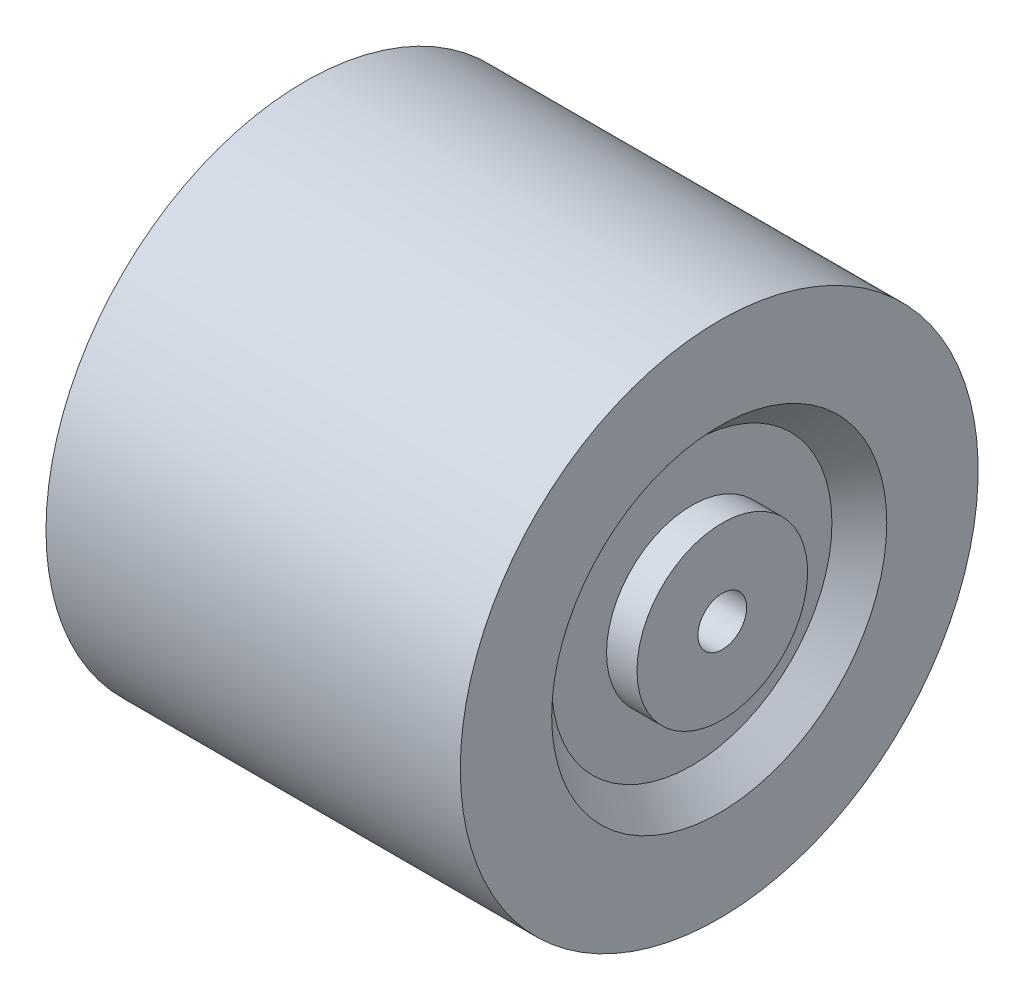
from build123d import *


with BuildPart() as part:
    # Esquisse1 → Base-R_volution (revolve)
    with BuildSketch(Plane.XY, mode=Mode.PRIVATE) as base_r_volution_sk:
        Polygon((34.5, 4), (34.5, 14), (29.5, 14), (29.5, 23), (34, 27.5), (34, 42.5), (0, 42.5), (0, 4), align=None)
    base_r_volution = revolve(base_r_volution_sk.sketch.rotate(Axis((0, 0, 0), (1, 0, 0)), 90), axis=Axis((0, 0, 0), (1, 0, 0)))

    # Sym_trie1: Base-R_volution across plane
    add(base_r_volution.mirror(Plane(origin=(0, 0, 0), x_dir=(0, 0, 1), z_dir=(1, 0, 0))))


solid = part.part
